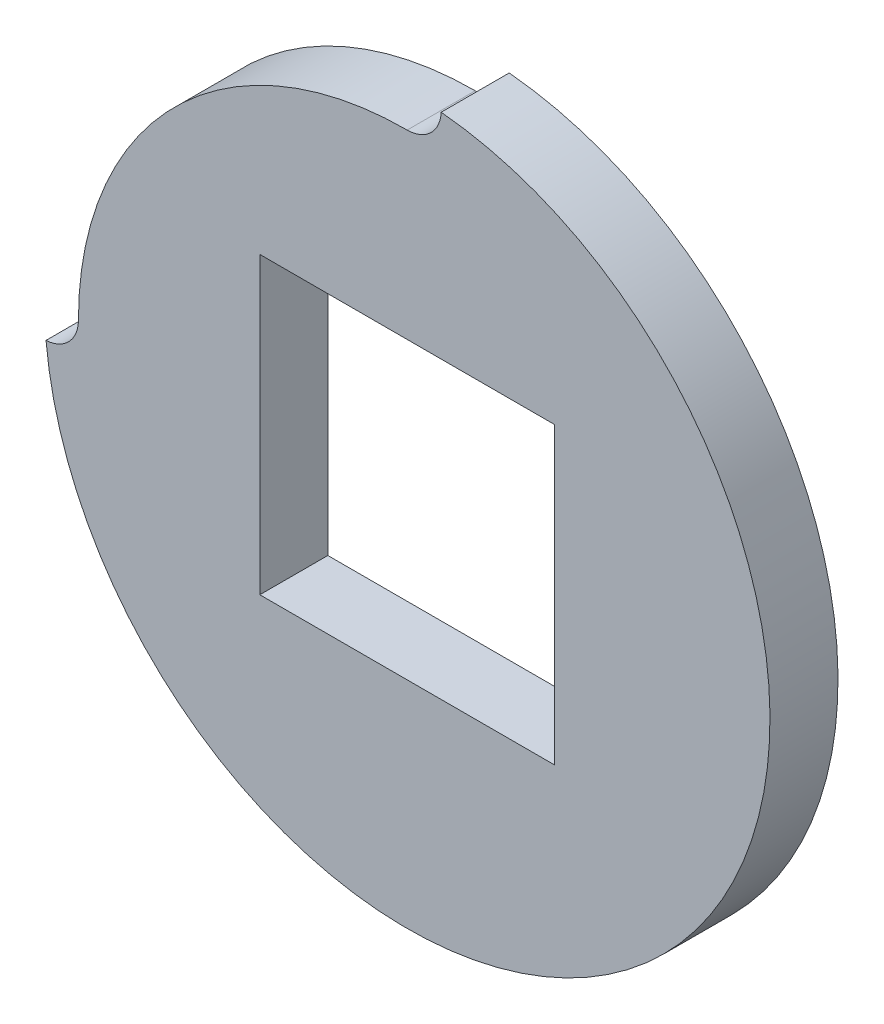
from build123d import *

# Parameters (mm, degrees)
ESQUISSE1_W          = 13
ESQUISSE1_H          = 13
BASE_EXTRUSION_DEPTH = 3


with BuildPart() as part:
    # Esquisse1 → Base-Extrusion (new body)
    with BuildSketch(Plane.XY):
        with BuildLine():
            ThreePointArc((-15.9296875, -1.498351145), (11.313708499, -11.313708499), (1.498351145, 15.9296875))
            ThreePointArc((1.498351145, 15.9296875), (1.035502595, 14.91476529), (0, 14.5))
            ThreePointArc((0, 14.5), (-10.253048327, 10.253048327), (-14.5, 0))
            ThreePointArc((-14.5, 0), (-14.91476529, -1.035502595), (-15.9296875, -1.498351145))
        make_face()
        Rectangle(ESQUISSE1_W, ESQUISSE1_H, mode=Mode.SUBTRACT)
    extrude(amount=BASE_EXTRUSION_DEPTH)


solid = part.part
